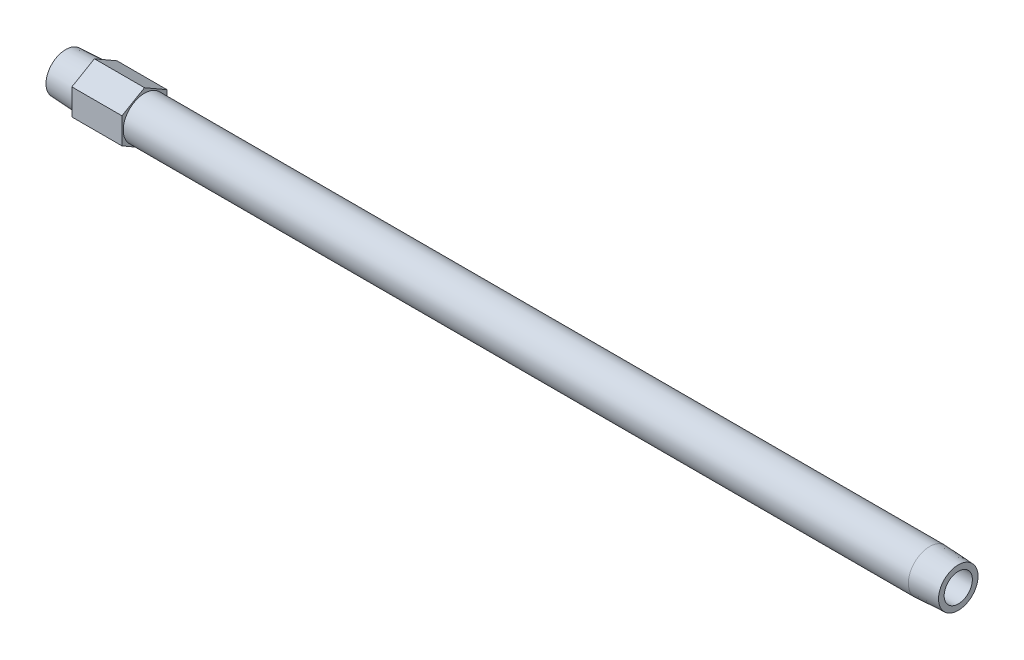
ISO-10303-21;
HEADER;
FILE_DESCRIPTION(('STEP AP214'),'2;1');
FILE_NAME('part.step','',(''),(''),'','','');
FILE_SCHEMA(('AUTOMOTIVE_DESIGN { 1 0 10303 214 1 1 1 1 }'));
ENDSEC;
DATA;
#1=APPLICATION_CONTEXT('core data for automotive mechanical design processes');
#2=APPLICATION_PROTOCOL_DEFINITION('international standard','automotive_design',2000,#1);
#3=PRODUCT_CONTEXT('',#1,'mechanical');
#4=PRODUCT('Part','Part','',(#3));
#5=PRODUCT_RELATED_PRODUCT_CATEGORY('part','',(#4));
#6=PRODUCT_DEFINITION_FORMATION('','',#4);
#7=PRODUCT_DEFINITION_CONTEXT('part definition',#1,'design');
#8=PRODUCT_DEFINITION('design','',#6,#7);
#9=PRODUCT_DEFINITION_SHAPE('','',#8);
#10=(LENGTH_UNIT() NAMED_UNIT(*) SI_UNIT(.MILLI.,.METRE.));
#11=(NAMED_UNIT(*) PLANE_ANGLE_UNIT() SI_UNIT($,.RADIAN.));
#12=(NAMED_UNIT(*) SI_UNIT($,.STERADIAN.) SOLID_ANGLE_UNIT());
#13=UNCERTAINTY_MEASURE_WITH_UNIT(LENGTH_MEASURE(1.E-05),#10,'distance_accuracy_value','');
#14=(GEOMETRIC_REPRESENTATION_CONTEXT(3) GLOBAL_UNCERTAINTY_ASSIGNED_CONTEXT((#13)) GLOBAL_UNIT_ASSIGNED_CONTEXT((#10,
#11,#12)) REPRESENTATION_CONTEXT('',''));
#15=CARTESIAN_POINT('',(0.,0.,0.));
#16=DIRECTION('',(0.,0.,1.));
#17=DIRECTION('',(1.,0.,0.));
#18=AXIS2_PLACEMENT_3D('',#15,#16,#17);
#19=CARTESIAN_POINT('',(0.,0.,-4.78009397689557));
#20=DIRECTION('',(1.,0.,0.));
#21=DIRECTION('',(0.,0.,-1.));
#22=AXIS2_PLACEMENT_3D('',#19,#20,#21);
#23=PLANE('',#22);
#24=CARTESIAN_POINT('',(0.,0.,0.));
#25=DIRECTION('',(-1.,0.,0.));
#26=DIRECTION('',(0.,0.,1.));
#27=AXIS2_PLACEMENT_3D('',#24,#25,#26);
#28=CIRCLE('',#27,4.78009397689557);
#29=CARTESIAN_POINT('',(0.,0.,4.78009397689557));
#30=VERTEX_POINT('',#29);
#31=EDGE_CURVE('E147',#30,#30,#28,.T.);
#32=ORIENTED_EDGE('',*,*,#31,.T.);
#33=EDGE_LOOP('',(#32));
#34=FACE_BOUND('',#33,.T.);
#35=CARTESIAN_POINT('',(0.,0.,0.));
#36=DIRECTION('',(1.,0.,0.));
#37=DIRECTION('',(0.,0.,1.));
#38=AXIS2_PLACEMENT_3D('',#35,#36,#37);
#39=CIRCLE('',#38,3.4163);
#40=CARTESIAN_POINT('',(0.,0.,3.4163));
#41=VERTEX_POINT('',#40);
#42=EDGE_CURVE('E159',#41,#41,#39,.T.);
#43=ORIENTED_EDGE('',*,*,#42,.T.);
#44=EDGE_LOOP('',(#43));
#45=FACE_BOUND('',#44,.T.);
#46=ADVANCED_FACE('F15',(#34,#45),#23,.F.);
#47=CARTESIAN_POINT('',(215.9,0.,-4.78009397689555));
#48=DIRECTION('',(-1.,0.,0.));
#49=DIRECTION('',(0.,0.,1.));
#50=AXIS2_PLACEMENT_3D('',#47,#48,#49);
#51=PLANE('',#50);
#52=CARTESIAN_POINT('',(215.9,0.,0.));
#53=DIRECTION('',(-1.,0.,0.));
#54=DIRECTION('',(0.,0.,1.));
#55=AXIS2_PLACEMENT_3D('',#52,#53,#54);
#56=CIRCLE('',#55,4.78009397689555);
#57=CARTESIAN_POINT('',(215.9,0.,4.78009397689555));
#58=VERTEX_POINT('',#57);
#59=EDGE_CURVE('E150',#58,#58,#56,.T.);
#60=ORIENTED_EDGE('',*,*,#59,.F.);
#61=EDGE_LOOP('',(#60));
#62=FACE_BOUND('',#61,.T.);
#63=CARTESIAN_POINT('',(215.9,0.,0.));
#64=DIRECTION('',(-1.,0.,0.));
#65=DIRECTION('',(0.,0.,1.));
#66=AXIS2_PLACEMENT_3D('',#63,#64,#65);
#67=CIRCLE('',#66,3.4163);
#68=CARTESIAN_POINT('',(215.9,0.,3.4163));
#69=VERTEX_POINT('',#68);
#70=EDGE_CURVE('E156',#69,#69,#67,.F.);
#71=ORIENTED_EDGE('',*,*,#70,.F.);
#72=EDGE_LOOP('',(#71));
#73=FACE_BOUND('',#72,.T.);
#74=ADVANCED_FACE('F178',(#62,#73),#51,.F.);
#75=CARTESIAN_POINT('',(19.05,-9.45872946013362,5.461));
#76=DIRECTION('',(-1.,0.,0.));
#77=DIRECTION('',(0.,-1.,0.));
#78=AXIS2_PLACEMENT_3D('',#75,#76,#77);
#79=PLANE('',#78);
#80=DIRECTION('',(0.,0.5,-0.866025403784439));
#81=VECTOR('',#80,1.);
#82=CARTESIAN_POINT('',(19.05,-6.30581964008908,0.));
#83=LINE('',#82,#81);
#84=CARTESIAN_POINT('',(19.05,-6.30581964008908,0.));
#85=VERTEX_POINT('',#84);
#86=CARTESIAN_POINT('',(19.05,-3.15290982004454,-5.461));
#87=VERTEX_POINT('',#86);
#88=EDGE_CURVE('E103',#85,#87,#83,.T.);
#89=ORIENTED_EDGE('',*,*,#88,.T.);
#90=DIRECTION('',(0.,1.,0.));
#91=VECTOR('',#90,1.);
#92=CARTESIAN_POINT('',(19.05,-3.15290982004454,-5.461));
#93=LINE('',#92,#91);
#94=CARTESIAN_POINT('',(19.05,3.15290982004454,-5.461));
#95=VERTEX_POINT('',#94);
#96=EDGE_CURVE('E83',#87,#95,#93,.T.);
#97=ORIENTED_EDGE('',*,*,#96,.T.);
#98=DIRECTION('',(0.,0.5,0.866025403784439));
#99=VECTOR('',#98,1.);
#100=CARTESIAN_POINT('',(19.05,3.15290982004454,-5.461));
#101=LINE('',#100,#99);
#102=CARTESIAN_POINT('',(19.05,6.30581964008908,0.));
#103=VERTEX_POINT('',#102);
#104=EDGE_CURVE('E102',#95,#103,#101,.T.);
#105=ORIENTED_EDGE('',*,*,#104,.T.);
#106=DIRECTION('',(0.,-0.5,0.866025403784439));
#107=VECTOR('',#106,1.);
#108=CARTESIAN_POINT('',(19.05,6.30581964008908,0.));
#109=LINE('',#108,#107);
#110=CARTESIAN_POINT('',(19.05,3.15290982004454,5.461));
#111=VERTEX_POINT('',#110);
#112=EDGE_CURVE('E105',#103,#111,#109,.T.);
#113=ORIENTED_EDGE('',*,*,#112,.T.);
#114=DIRECTION('',(0.,-1.,0.));
#115=VECTOR('',#114,1.);
#116=CARTESIAN_POINT('',(19.05,3.15290982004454,5.461));
#117=LINE('',#116,#115);
#118=CARTESIAN_POINT('',(19.05,-3.15290982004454,5.461));
#119=VERTEX_POINT('',#118);
#120=EDGE_CURVE('E35',#111,#119,#117,.T.);
#121=ORIENTED_EDGE('',*,*,#120,.T.);
#122=DIRECTION('',(0.,-0.5,-0.866025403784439));
#123=VECTOR('',#122,1.);
#124=CARTESIAN_POINT('',(19.05,-3.15290982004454,5.461));
#125=LINE('',#124,#123);
#126=EDGE_CURVE('E30',#119,#85,#125,.T.);
#127=ORIENTED_EDGE('',*,*,#126,.T.);
#128=EDGE_LOOP('',(#89,#97,#105,#113,#121,#127));
#129=FACE_BOUND('',#128,.T.);
#130=CARTESIAN_POINT('',(19.05,0.,0.));
#131=DIRECTION('',(-1.,0.,0.));
#132=DIRECTION('',(0.,-1.,0.));
#133=AXIS2_PLACEMENT_3D('',#130,#131,#132);
#134=CIRCLE('',#133,5.1435);
#135=CARTESIAN_POINT('',(19.05,-5.1435,0.));
#136=VERTEX_POINT('',#135);
#137=EDGE_CURVE('E89',#136,#136,#134,.F.);
#138=ORIENTED_EDGE('',*,*,#137,.F.);
#139=EDGE_LOOP('',(#138));
#140=FACE_BOUND('',#139,.T.);
#141=ADVANCED_FACE('F124',(#129,#140),#79,.F.);
#142=CARTESIAN_POINT('',(6.9342,-9.45872946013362,5.461));
#143=DIRECTION('',(-1.,0.,0.));
#144=DIRECTION('',(0.,-1.,0.));
#145=AXIS2_PLACEMENT_3D('',#142,#143,#144);
#146=PLANE('',#145);
#147=DIRECTION('',(0.,0.5,-0.866025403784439));
#148=VECTOR('',#147,1.);
#149=CARTESIAN_POINT('',(6.9342,-6.30581964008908,0.));
#150=LINE('',#149,#148);
#151=CARTESIAN_POINT('',(6.9342,-6.30581964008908,0.));
#152=VERTEX_POINT('',#151);
#153=CARTESIAN_POINT('',(6.9342,-3.15290982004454,-5.461));
#154=VERTEX_POINT('',#153);
#155=EDGE_CURVE('E73',#152,#154,#150,.T.);
#156=ORIENTED_EDGE('',*,*,#155,.F.);
#157=DIRECTION('',(0.,-0.5,-0.866025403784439));
#158=VECTOR('',#157,1.);
#159=CARTESIAN_POINT('',(6.9342,-3.15290982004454,5.461));
#160=LINE('',#159,#158);
#161=CARTESIAN_POINT('',(6.9342,-3.15290982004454,5.461));
#162=VERTEX_POINT('',#161);
#163=EDGE_CURVE('E99',#162,#152,#160,.T.);
#164=ORIENTED_EDGE('',*,*,#163,.F.);
#165=DIRECTION('',(0.,-1.,0.));
#166=VECTOR('',#165,1.);
#167=CARTESIAN_POINT('',(6.9342,3.15290982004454,5.461));
#168=LINE('',#167,#166);
#169=CARTESIAN_POINT('',(6.9342,3.15290982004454,5.461));
#170=VERTEX_POINT('',#169);
#171=EDGE_CURVE('E133',#170,#162,#168,.T.);
#172=ORIENTED_EDGE('',*,*,#171,.F.);
#173=DIRECTION('',(0.,-0.5,0.866025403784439));
#174=VECTOR('',#173,1.);
#175=CARTESIAN_POINT('',(6.9342,6.30581964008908,0.));
#176=LINE('',#175,#174);
#177=CARTESIAN_POINT('',(6.9342,6.30581964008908,0.));
#178=VERTEX_POINT('',#177);
#179=EDGE_CURVE('E129',#178,#170,#176,.T.);
#180=ORIENTED_EDGE('',*,*,#179,.F.);
#181=DIRECTION('',(0.,0.5,0.866025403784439));
#182=VECTOR('',#181,1.);
#183=CARTESIAN_POINT('',(6.9342,3.15290982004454,-5.461));
#184=LINE('',#183,#182);
#185=CARTESIAN_POINT('',(6.9342,3.15290982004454,-5.461));
#186=VERTEX_POINT('',#185);
#187=EDGE_CURVE('E75',#186,#178,#184,.T.);
#188=ORIENTED_EDGE('',*,*,#187,.F.);
#189=DIRECTION('',(0.,1.,0.));
#190=VECTOR('',#189,1.);
#191=CARTESIAN_POINT('',(6.9342,-3.15290982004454,-5.461));
#192=LINE('',#191,#190);
#193=EDGE_CURVE('E68',#154,#186,#192,.T.);
#194=ORIENTED_EDGE('',*,*,#193,.F.);
#195=EDGE_LOOP('',(#156,#164,#172,#180,#188,#194));
#196=FACE_BOUND('',#195,.T.);
#197=CARTESIAN_POINT('',(6.9342,0.,0.));
#198=DIRECTION('',(-1.,0.,0.));
#199=DIRECTION('',(0.,0.,1.));
#200=AXIS2_PLACEMENT_3D('',#197,#198,#199);
#201=CIRCLE('',#200,5.1435);
#202=CARTESIAN_POINT('',(6.9342,0.,5.1435));
#203=VERTEX_POINT('',#202);
#204=EDGE_CURVE('E95',#203,#203,#201,.T.);
#205=ORIENTED_EDGE('',*,*,#204,.F.);
#206=EDGE_LOOP('',(#205));
#207=FACE_BOUND('',#206,.T.);
#208=ADVANCED_FACE('F69',(#196,#207),#146,.T.);
#209=CARTESIAN_POINT('',(19.05,-6.30581964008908,0.));
#210=DIRECTION('',(0.,0.866025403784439,0.5));
#211=DIRECTION('',(0.,-0.5,0.866025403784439));
#212=AXIS2_PLACEMENT_3D('',#209,#210,#211);
#213=PLANE('',#212);
#214=ORIENTED_EDGE('',*,*,#155,.T.);
#215=DIRECTION('',(-1.,0.,0.));
#216=VECTOR('',#215,1.);
#217=CARTESIAN_POINT('',(19.05,-3.15290982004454,-5.461));
#218=LINE('',#217,#216);
#219=EDGE_CURVE('E10',#87,#154,#218,.T.);
#220=ORIENTED_EDGE('',*,*,#219,.F.);
#221=ORIENTED_EDGE('',*,*,#88,.F.);
#222=DIRECTION('',(-1.,0.,0.));
#223=VECTOR('',#222,1.);
#224=CARTESIAN_POINT('',(19.05,-6.30581964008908,0.));
#225=LINE('',#224,#223);
#226=EDGE_CURVE('E87',#85,#152,#225,.T.);
#227=ORIENTED_EDGE('',*,*,#226,.T.);
#228=EDGE_LOOP('',(#214,#220,#221,#227));
#229=FACE_BOUND('',#228,.T.);
#230=ADVANCED_FACE('F17',(#229),#213,.F.);
#231=CARTESIAN_POINT('',(19.05,-3.15290982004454,-5.461));
#232=DIRECTION('',(0.,0.,1.));
#233=DIRECTION('',(0.,-1.,0.));
#234=AXIS2_PLACEMENT_3D('',#231,#232,#233);
#235=PLANE('',#234);
#236=ORIENTED_EDGE('',*,*,#193,.T.);
#237=DIRECTION('',(-1.,0.,0.));
#238=VECTOR('',#237,1.);
#239=CARTESIAN_POINT('',(19.05,3.15290982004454,-5.461));
#240=LINE('',#239,#238);
#241=EDGE_CURVE('E23',#95,#186,#240,.T.);
#242=ORIENTED_EDGE('',*,*,#241,.F.);
#243=ORIENTED_EDGE('',*,*,#96,.F.);
#244=ORIENTED_EDGE('',*,*,#219,.T.);
#245=EDGE_LOOP('',(#236,#242,#243,#244));
#246=FACE_BOUND('',#245,.T.);
#247=ADVANCED_FACE('F82',(#246),#235,.F.);
#248=CARTESIAN_POINT('',(19.05,3.15290982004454,-5.461));
#249=DIRECTION('',(0.,-0.866025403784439,0.5));
#250=DIRECTION('',(0.,-0.5,-0.866025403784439));
#251=AXIS2_PLACEMENT_3D('',#248,#249,#250);
#252=PLANE('',#251);
#253=ORIENTED_EDGE('',*,*,#187,.T.);
#254=DIRECTION('',(-1.,0.,0.));
#255=VECTOR('',#254,1.);
#256=CARTESIAN_POINT('',(19.05,6.30581964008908,0.));
#257=LINE('',#256,#255);
#258=EDGE_CURVE('E117',#103,#178,#257,.T.);
#259=ORIENTED_EDGE('',*,*,#258,.F.);
#260=ORIENTED_EDGE('',*,*,#104,.F.);
#261=ORIENTED_EDGE('',*,*,#241,.T.);
#262=EDGE_LOOP('',(#253,#259,#260,#261));
#263=FACE_BOUND('',#262,.T.);
#264=ADVANCED_FACE('F121',(#263),#252,.F.);
#265=CARTESIAN_POINT('',(19.05,6.30581964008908,0.));
#266=DIRECTION('',(0.,-0.866025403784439,-0.5));
#267=DIRECTION('',(0.,0.5,-0.866025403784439));
#268=AXIS2_PLACEMENT_3D('',#265,#266,#267);
#269=PLANE('',#268);
#270=ORIENTED_EDGE('',*,*,#179,.T.);
#271=DIRECTION('',(-1.,0.,0.));
#272=VECTOR('',#271,1.);
#273=CARTESIAN_POINT('',(19.05,3.15290982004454,5.461));
#274=LINE('',#273,#272);
#275=EDGE_CURVE('E114',#111,#170,#274,.T.);
#276=ORIENTED_EDGE('',*,*,#275,.F.);
#277=ORIENTED_EDGE('',*,*,#112,.F.);
#278=ORIENTED_EDGE('',*,*,#258,.T.);
#279=EDGE_LOOP('',(#270,#276,#277,#278));
#280=FACE_BOUND('',#279,.T.);
#281=ADVANCED_FACE('F128',(#280),#269,.F.);
#282=CARTESIAN_POINT('',(19.05,3.15290982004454,5.461));
#283=DIRECTION('',(0.,0.,-1.));
#284=DIRECTION('',(-1.,0.,0.));
#285=AXIS2_PLACEMENT_3D('',#282,#283,#284);
#286=PLANE('',#285);
#287=ORIENTED_EDGE('',*,*,#171,.T.);
#288=DIRECTION('',(-1.,0.,0.));
#289=VECTOR('',#288,1.);
#290=CARTESIAN_POINT('',(19.05,-3.15290982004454,5.461));
#291=LINE('',#290,#289);
#292=EDGE_CURVE('E111',#119,#162,#291,.T.);
#293=ORIENTED_EDGE('',*,*,#292,.F.);
#294=ORIENTED_EDGE('',*,*,#120,.F.);
#295=ORIENTED_EDGE('',*,*,#275,.T.);
#296=EDGE_LOOP('',(#287,#293,#294,#295));
#297=FACE_BOUND('',#296,.T.);
#298=ADVANCED_FACE('F132',(#297),#286,.F.);
#299=CARTESIAN_POINT('',(19.05,-3.15290982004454,5.461));
#300=DIRECTION('',(0.,0.866025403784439,-0.5));
#301=DIRECTION('',(0.,0.5,0.866025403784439));
#302=AXIS2_PLACEMENT_3D('',#299,#300,#301);
#303=PLANE('',#302);
#304=ORIENTED_EDGE('',*,*,#163,.T.);
#305=ORIENTED_EDGE('',*,*,#226,.F.);
#306=ORIENTED_EDGE('',*,*,#126,.F.);
#307=ORIENTED_EDGE('',*,*,#292,.T.);
#308=EDGE_LOOP('',(#304,#305,#306,#307));
#309=FACE_BOUND('',#308,.T.);
#310=ADVANCED_FACE('F135',(#309),#303,.F.);
#311=CARTESIAN_POINT('',(6.9342,0.,0.));
#312=DIRECTION('',(1.,0.,0.));
#313=DIRECTION('',(0.,0.,-1.));
#314=AXIS2_PLACEMENT_3D('',#311,#312,#313);
#315=CONICAL_SURFACE('',#314,5.1435,0.0523598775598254);
#316=ORIENTED_EDGE('',*,*,#31,.F.);
#317=EDGE_LOOP('',(#316));
#318=FACE_BOUND('',#317,.T.);
#319=ORIENTED_EDGE('',*,*,#204,.T.);
#320=EDGE_LOOP('',(#319));
#321=FACE_BOUND('',#320,.T.);
#322=ADVANCED_FACE('F187',(#318,#321),#315,.T.);
#323=CARTESIAN_POINT('',(-60.,0.,0.));
#324=DIRECTION('',(-1.,0.,0.));
#325=DIRECTION('',(0.,0.,1.));
#326=AXIS2_PLACEMENT_3D('',#323,#324,#325);
#327=CYLINDRICAL_SURFACE('',#326,5.1435);
#328=ORIENTED_EDGE('',*,*,#137,.T.);
#329=EDGE_LOOP('',(#328));
#330=FACE_BOUND('',#329,.T.);
#331=CARTESIAN_POINT('',(208.9658,0.,0.));
#332=DIRECTION('',(-1.,0.,0.));
#333=DIRECTION('',(0.,0.,1.));
#334=AXIS2_PLACEMENT_3D('',#331,#332,#333);
#335=CIRCLE('',#334,5.1435);
#336=CARTESIAN_POINT('',(208.9658,0.,5.1435));
#337=VERTEX_POINT('',#336);
#338=EDGE_CURVE('E153',#337,#337,#335,.T.);
#339=ORIENTED_EDGE('',*,*,#338,.T.);
#340=EDGE_LOOP('',(#339));
#341=FACE_BOUND('',#340,.T.);
#342=ADVANCED_FACE('F174',(#330,#341),#327,.T.);
#343=CARTESIAN_POINT('',(215.9,0.,0.));
#344=DIRECTION('',(-1.,0.,0.));
#345=DIRECTION('',(0.,0.,1.));
#346=AXIS2_PLACEMENT_3D('',#343,#344,#345);
#347=CONICAL_SURFACE('',#346,4.78009397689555,0.052359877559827);
#348=ORIENTED_EDGE('',*,*,#338,.F.);
#349=EDGE_LOOP('',(#348));
#350=FACE_BOUND('',#349,.T.);
#351=ORIENTED_EDGE('',*,*,#59,.T.);
#352=EDGE_LOOP('',(#351));
#353=FACE_BOUND('',#352,.T.);
#354=ADVANCED_FACE('F167',(#350,#353),#347,.T.);
#355=CARTESIAN_POINT('',(216.543652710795,0.,0.));
#356=DIRECTION('',(-1.,0.,0.));
#357=DIRECTION('',(0.,0.,1.));
#358=AXIS2_PLACEMENT_3D('',#355,#356,#357);
#359=CYLINDRICAL_SURFACE('',#358,3.4163);
#360=ORIENTED_EDGE('',*,*,#70,.T.);
#361=EDGE_LOOP('',(#360));
#362=FACE_BOUND('',#361,.T.);
#363=ORIENTED_EDGE('',*,*,#42,.F.);
#364=EDGE_LOOP('',(#363));
#365=FACE_BOUND('',#364,.T.);
#366=ADVANCED_FACE('F165',(#362,#365),#359,.F.);
#367=CLOSED_SHELL('',(#46,#74,#141,#208,#230,#247,#264,#281,#298,#310,#322,#342,#354,#366));
#368=MANIFOLD_SOLID_BREP('B1',#367);
#369=ADVANCED_BREP_SHAPE_REPRESENTATION('',(#18,#368),#14);
#370=SHAPE_DEFINITION_REPRESENTATION(#9,#369);
ENDSEC;
END-ISO-10303-21;
